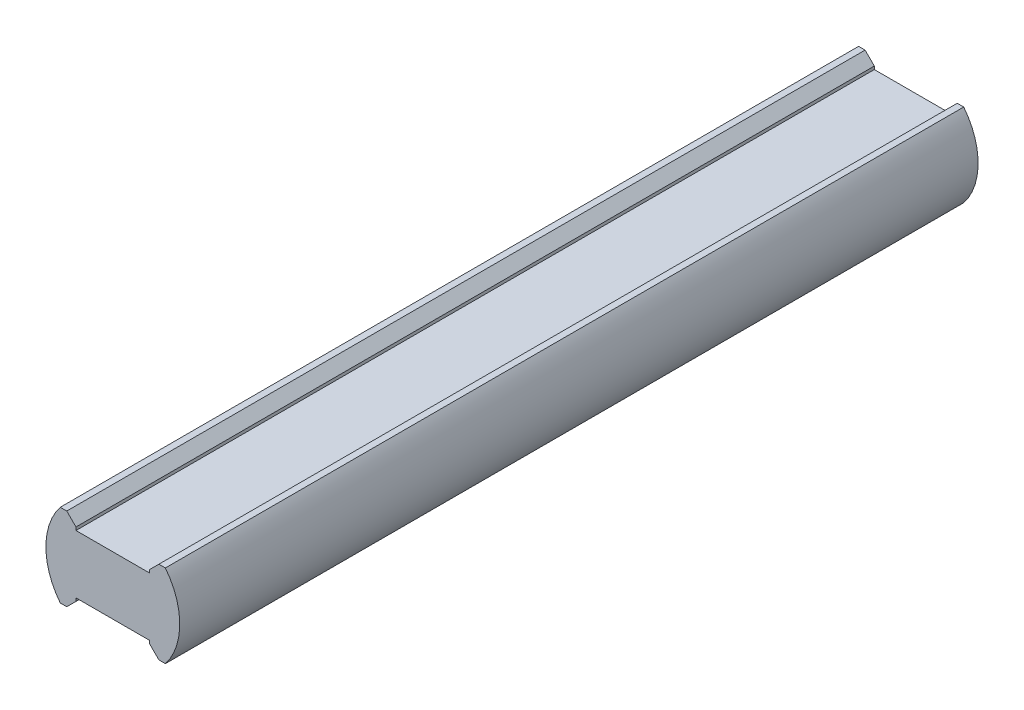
ISO-10303-21;
HEADER;
FILE_DESCRIPTION(('STEP AP214'),'2;1');
FILE_NAME('part.step','',(''),(''),'','','');
FILE_SCHEMA(('AUTOMOTIVE_DESIGN { 1 0 10303 214 1 1 1 1 }'));
ENDSEC;
DATA;
#1=APPLICATION_CONTEXT('core data for automotive mechanical design processes');
#2=APPLICATION_PROTOCOL_DEFINITION('international standard','automotive_design',2000,#1);
#3=PRODUCT_CONTEXT('',#1,'mechanical');
#4=PRODUCT('Part','Part','',(#3));
#5=PRODUCT_RELATED_PRODUCT_CATEGORY('part','',(#4));
#6=PRODUCT_DEFINITION_FORMATION('','',#4);
#7=PRODUCT_DEFINITION_CONTEXT('part definition',#1,'design');
#8=PRODUCT_DEFINITION('design','',#6,#7);
#9=PRODUCT_DEFINITION_SHAPE('','',#8);
#10=(LENGTH_UNIT() NAMED_UNIT(*) SI_UNIT(.MILLI.,.METRE.));
#11=(NAMED_UNIT(*) PLANE_ANGLE_UNIT() SI_UNIT($,.RADIAN.));
#12=(NAMED_UNIT(*) SI_UNIT($,.STERADIAN.) SOLID_ANGLE_UNIT());
#13=UNCERTAINTY_MEASURE_WITH_UNIT(LENGTH_MEASURE(1.E-05),#10,'distance_accuracy_value','');
#14=(GEOMETRIC_REPRESENTATION_CONTEXT(3) GLOBAL_UNCERTAINTY_ASSIGNED_CONTEXT((#13)) GLOBAL_UNIT_ASSIGNED_CONTEXT((#10,
#11,#12)) REPRESENTATION_CONTEXT('',''));
#15=CARTESIAN_POINT('',(0.,0.,0.));
#16=DIRECTION('',(0.,0.,1.));
#17=DIRECTION('',(1.,0.,0.));
#18=AXIS2_PLACEMENT_3D('',#15,#16,#17);
#19=CARTESIAN_POINT('',(7.5,6.75,130.));
#20=DIRECTION('',(0.,-1.,0.));
#21=DIRECTION('',(0.,0.,-1.));
#22=AXIS2_PLACEMENT_3D('',#19,#20,#21);
#23=PLANE('',#22);
#24=DIRECTION('',(-1.,0.,0.));
#25=VECTOR('',#24,1.);
#26=CARTESIAN_POINT('',(7.5,6.75,0.));
#27=LINE('',#26,#25);
#28=CARTESIAN_POINT('',(8.55847533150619,6.75,0.));
#29=VERTEX_POINT('',#28);
#30=CARTESIAN_POINT('',(7.5,6.75,0.));
#31=VERTEX_POINT('',#30);
#32=EDGE_CURVE('E193',#29,#31,#27,.T.);
#33=ORIENTED_EDGE('',*,*,#32,.T.);
#34=DIRECTION('',(0.,0.,-1.));
#35=VECTOR('',#34,1.);
#36=CARTESIAN_POINT('',(7.5,6.75,130.));
#37=LINE('',#36,#35);
#38=CARTESIAN_POINT('',(7.5,6.75,130.));
#39=VERTEX_POINT('',#38);
#40=EDGE_CURVE('E48',#39,#31,#37,.T.);
#41=ORIENTED_EDGE('',*,*,#40,.F.);
#42=DIRECTION('',(-1.,0.,0.));
#43=VECTOR('',#42,1.);
#44=CARTESIAN_POINT('',(7.5,6.75,130.));
#45=LINE('',#44,#43);
#46=CARTESIAN_POINT('',(8.55847533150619,6.75,130.));
#47=VERTEX_POINT('',#46);
#48=EDGE_CURVE('E125',#47,#39,#45,.T.);
#49=ORIENTED_EDGE('',*,*,#48,.F.);
#50=DIRECTION('',(0.,0.,-1.));
#51=VECTOR('',#50,1.);
#52=CARTESIAN_POINT('',(8.55847533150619,6.75,130.));
#53=LINE('',#52,#51);
#54=EDGE_CURVE('E11',#47,#29,#53,.T.);
#55=ORIENTED_EDGE('',*,*,#54,.T.);
#56=EDGE_LOOP('',(#33,#41,#49,#55));
#57=FACE_BOUND('',#56,.T.);
#58=ADVANCED_FACE('F39',(#57),#23,.F.);
#59=CARTESIAN_POINT('',(6.,5.25,130.));
#60=DIRECTION('',(0.707106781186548,-0.707106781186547,0.));
#61=DIRECTION('',(0.707106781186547,0.707106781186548,0.));
#62=AXIS2_PLACEMENT_3D('',#59,#60,#61);
#63=PLANE('',#62);
#64=DIRECTION('',(-0.707106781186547,-0.707106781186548,0.));
#65=VECTOR('',#64,1.);
#66=CARTESIAN_POINT('',(6.,5.25,0.));
#67=LINE('',#66,#65);
#68=CARTESIAN_POINT('',(6.,5.25,0.));
#69=VERTEX_POINT('',#68);
#70=EDGE_CURVE('E196',#31,#69,#67,.T.);
#71=ORIENTED_EDGE('',*,*,#70,.T.);
#72=DIRECTION('',(0.,0.,-1.));
#73=VECTOR('',#72,1.);
#74=CARTESIAN_POINT('',(6.,5.25,130.));
#75=LINE('',#74,#73);
#76=CARTESIAN_POINT('',(6.,5.25,130.));
#77=VERTEX_POINT('',#76);
#78=EDGE_CURVE('E281',#77,#69,#75,.T.);
#79=ORIENTED_EDGE('',*,*,#78,.F.);
#80=DIRECTION('',(-0.707106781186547,-0.707106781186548,0.));
#81=VECTOR('',#80,1.);
#82=CARTESIAN_POINT('',(6.,5.25,130.));
#83=LINE('',#82,#81);
#84=EDGE_CURVE('E291',#39,#77,#83,.T.);
#85=ORIENTED_EDGE('',*,*,#84,.F.);
#86=ORIENTED_EDGE('',*,*,#40,.T.);
#87=EDGE_LOOP('',(#71,#79,#85,#86));
#88=FACE_BOUND('',#87,.T.);
#89=ADVANCED_FACE('F289',(#88),#63,.F.);
#90=CARTESIAN_POINT('',(6.,5.25,130.));
#91=DIRECTION('',(1.,0.,0.));
#92=DIRECTION('',(0.,1.,0.));
#93=AXIS2_PLACEMENT_3D('',#90,#91,#92);
#94=PLANE('',#93);
#95=DIRECTION('',(0.,-1.,0.));
#96=VECTOR('',#95,1.);
#97=CARTESIAN_POINT('',(6.,5.25,0.));
#98=LINE('',#97,#96);
#99=CARTESIAN_POINT('',(6.,4.75,0.));
#100=VERTEX_POINT('',#99);
#101=EDGE_CURVE('E199',#69,#100,#98,.T.);
#102=ORIENTED_EDGE('',*,*,#101,.T.);
#103=DIRECTION('',(0.,0.,-1.));
#104=VECTOR('',#103,1.);
#105=CARTESIAN_POINT('',(6.,4.75,130.));
#106=LINE('',#105,#104);
#107=CARTESIAN_POINT('',(6.,4.75,130.));
#108=VERTEX_POINT('',#107);
#109=EDGE_CURVE('E277',#108,#100,#106,.T.);
#110=ORIENTED_EDGE('',*,*,#109,.F.);
#111=DIRECTION('',(0.,-1.,0.));
#112=VECTOR('',#111,1.);
#113=CARTESIAN_POINT('',(6.,5.25,130.));
#114=LINE('',#113,#112);
#115=EDGE_CURVE('E308',#77,#108,#114,.T.);
#116=ORIENTED_EDGE('',*,*,#115,.F.);
#117=ORIENTED_EDGE('',*,*,#78,.T.);
#118=EDGE_LOOP('',(#102,#110,#116,#117));
#119=FACE_BOUND('',#118,.T.);
#120=ADVANCED_FACE('F298',(#119),#94,.F.);
#121=CARTESIAN_POINT('',(-6.,4.75,130.));
#122=DIRECTION('',(0.,-1.,0.));
#123=DIRECTION('',(1.,0.,0.));
#124=AXIS2_PLACEMENT_3D('',#121,#122,#123);
#125=PLANE('',#124);
#126=DIRECTION('',(-1.,0.,0.));
#127=VECTOR('',#126,1.);
#128=CARTESIAN_POINT('',(-6.,4.75,0.));
#129=LINE('',#128,#127);
#130=CARTESIAN_POINT('',(-6.,4.75,0.));
#131=VERTEX_POINT('',#130);
#132=EDGE_CURVE('E202',#100,#131,#129,.T.);
#133=ORIENTED_EDGE('',*,*,#132,.T.);
#134=DIRECTION('',(0.,0.,-1.));
#135=VECTOR('',#134,1.);
#136=CARTESIAN_POINT('',(-6.,4.75,130.));
#137=LINE('',#136,#135);
#138=CARTESIAN_POINT('',(-6.,4.75,130.));
#139=VERTEX_POINT('',#138);
#140=EDGE_CURVE('E273',#139,#131,#137,.T.);
#141=ORIENTED_EDGE('',*,*,#140,.F.);
#142=DIRECTION('',(-1.,0.,0.));
#143=VECTOR('',#142,1.);
#144=CARTESIAN_POINT('',(-6.,4.75,130.));
#145=LINE('',#144,#143);
#146=EDGE_CURVE('E304',#108,#139,#145,.T.);
#147=ORIENTED_EDGE('',*,*,#146,.F.);
#148=ORIENTED_EDGE('',*,*,#109,.T.);
#149=EDGE_LOOP('',(#133,#141,#147,#148));
#150=FACE_BOUND('',#149,.T.);
#151=ADVANCED_FACE('F302',(#150),#125,.F.);
#152=CARTESIAN_POINT('',(-6.,5.25,130.));
#153=DIRECTION('',(-1.,0.,0.));
#154=DIRECTION('',(0.,0.,1.));
#155=AXIS2_PLACEMENT_3D('',#152,#153,#154);
#156=PLANE('',#155);
#157=DIRECTION('',(0.,1.,0.));
#158=VECTOR('',#157,1.);
#159=CARTESIAN_POINT('',(-6.,5.25,0.));
#160=LINE('',#159,#158);
#161=CARTESIAN_POINT('',(-6.,5.25,0.));
#162=VERTEX_POINT('',#161);
#163=EDGE_CURVE('E205',#131,#162,#160,.T.);
#164=ORIENTED_EDGE('',*,*,#163,.T.);
#165=DIRECTION('',(0.,0.,-1.));
#166=VECTOR('',#165,1.);
#167=CARTESIAN_POINT('',(-6.,5.25,130.));
#168=LINE('',#167,#166);
#169=CARTESIAN_POINT('',(-6.,5.25,130.));
#170=VERTEX_POINT('',#169);
#171=EDGE_CURVE('E269',#170,#162,#168,.T.);
#172=ORIENTED_EDGE('',*,*,#171,.F.);
#173=DIRECTION('',(0.,1.,0.));
#174=VECTOR('',#173,1.);
#175=CARTESIAN_POINT('',(-6.,5.25,130.));
#176=LINE('',#175,#174);
#177=EDGE_CURVE('E307',#139,#170,#176,.T.);
#178=ORIENTED_EDGE('',*,*,#177,.F.);
#179=ORIENTED_EDGE('',*,*,#140,.T.);
#180=EDGE_LOOP('',(#164,#172,#178,#179));
#181=FACE_BOUND('',#180,.T.);
#182=ADVANCED_FACE('F359',(#181),#156,.F.);
#183=CARTESIAN_POINT('',(-7.5,6.75,130.));
#184=DIRECTION('',(-0.707106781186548,-0.707106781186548,0.));
#185=DIRECTION('',(0.707106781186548,-0.707106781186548,0.));
#186=AXIS2_PLACEMENT_3D('',#183,#184,#185);
#187=PLANE('',#186);
#188=DIRECTION('',(-0.707106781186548,0.707106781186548,0.));
#189=VECTOR('',#188,1.);
#190=CARTESIAN_POINT('',(-7.5,6.75,0.));
#191=LINE('',#190,#189);
#192=CARTESIAN_POINT('',(-7.5,6.75,0.));
#193=VERTEX_POINT('',#192);
#194=EDGE_CURVE('E208',#162,#193,#191,.T.);
#195=ORIENTED_EDGE('',*,*,#194,.T.);
#196=DIRECTION('',(0.,0.,-1.));
#197=VECTOR('',#196,1.);
#198=CARTESIAN_POINT('',(-7.5,6.75,130.));
#199=LINE('',#198,#197);
#200=CARTESIAN_POINT('',(-7.5,6.75,130.));
#201=VERTEX_POINT('',#200);
#202=EDGE_CURVE('E265',#201,#193,#199,.T.);
#203=ORIENTED_EDGE('',*,*,#202,.F.);
#204=DIRECTION('',(-0.707106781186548,0.707106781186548,0.));
#205=VECTOR('',#204,1.);
#206=CARTESIAN_POINT('',(-7.5,6.75,130.));
#207=LINE('',#206,#205);
#208=EDGE_CURVE('E312',#170,#201,#207,.T.);
#209=ORIENTED_EDGE('',*,*,#208,.F.);
#210=ORIENTED_EDGE('',*,*,#171,.T.);
#211=EDGE_LOOP('',(#195,#203,#209,#210));
#212=FACE_BOUND('',#211,.T.);
#213=ADVANCED_FACE('F362',(#212),#187,.F.);
#214=CARTESIAN_POINT('',(-8.55847533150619,6.75,130.));
#215=DIRECTION('',(0.,-1.,0.));
#216=DIRECTION('',(0.,0.,-1.));
#217=AXIS2_PLACEMENT_3D('',#214,#215,#216);
#218=PLANE('',#217);
#219=DIRECTION('',(-1.,0.,0.));
#220=VECTOR('',#219,1.);
#221=CARTESIAN_POINT('',(-8.55847533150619,6.75,0.));
#222=LINE('',#221,#220);
#223=CARTESIAN_POINT('',(-8.55847533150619,6.75,0.));
#224=VERTEX_POINT('',#223);
#225=EDGE_CURVE('E211',#193,#224,#222,.T.);
#226=ORIENTED_EDGE('',*,*,#225,.T.);
#227=DIRECTION('',(0.,0.,-1.));
#228=VECTOR('',#227,1.);
#229=CARTESIAN_POINT('',(-8.55847533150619,6.75,130.));
#230=LINE('',#229,#228);
#231=CARTESIAN_POINT('',(-8.55847533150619,6.75,130.));
#232=VERTEX_POINT('',#231);
#233=EDGE_CURVE('E261',#232,#224,#230,.T.);
#234=ORIENTED_EDGE('',*,*,#233,.F.);
#235=DIRECTION('',(-1.,0.,0.));
#236=VECTOR('',#235,1.);
#237=CARTESIAN_POINT('',(-8.55847533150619,6.75,130.));
#238=LINE('',#237,#236);
#239=EDGE_CURVE('E319',#201,#232,#238,.T.);
#240=ORIENTED_EDGE('',*,*,#239,.F.);
#241=ORIENTED_EDGE('',*,*,#202,.T.);
#242=EDGE_LOOP('',(#226,#234,#240,#241));
#243=FACE_BOUND('',#242,.T.);
#244=ADVANCED_FACE('F366',(#243),#218,.F.);
#245=CARTESIAN_POINT('',(0.,0.,130.));
#246=DIRECTION('',(0.,0.,-1.));
#247=DIRECTION('',(-1.,0.,0.));
#248=AXIS2_PLACEMENT_3D('',#245,#246,#247);
#249=CYLINDRICAL_SURFACE('',#248,10.9);
#250=CARTESIAN_POINT('',(0.,0.,0.));
#251=DIRECTION('',(0.,0.,1.));
#252=DIRECTION('',(1.,0.,0.));
#253=AXIS2_PLACEMENT_3D('',#250,#251,#252);
#254=CIRCLE('',#253,10.9);
#255=CARTESIAN_POINT('',(-8.55847533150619,-6.75,0.));
#256=VERTEX_POINT('',#255);
#257=EDGE_CURVE('E215',#224,#256,#254,.T.);
#258=ORIENTED_EDGE('',*,*,#257,.T.);
#259=DIRECTION('',(0.,0.,-1.));
#260=VECTOR('',#259,1.);
#261=CARTESIAN_POINT('',(-8.55847533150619,-6.75,130.));
#262=LINE('',#261,#260);
#263=CARTESIAN_POINT('',(-8.55847533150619,-6.75,130.));
#264=VERTEX_POINT('',#263);
#265=EDGE_CURVE('E257',#264,#256,#262,.T.);
#266=ORIENTED_EDGE('',*,*,#265,.F.);
#267=CARTESIAN_POINT('',(0.,0.,130.));
#268=DIRECTION('',(0.,0.,1.));
#269=DIRECTION('',(1.,0.,0.));
#270=AXIS2_PLACEMENT_3D('',#267,#268,#269);
#271=CIRCLE('',#270,10.9);
#272=EDGE_CURVE('E322',#232,#264,#271,.T.);
#273=ORIENTED_EDGE('',*,*,#272,.F.);
#274=ORIENTED_EDGE('',*,*,#233,.T.);
#275=EDGE_LOOP('',(#258,#266,#273,#274));
#276=FACE_BOUND('',#275,.T.);
#277=ADVANCED_FACE('F370',(#276),#249,.T.);
#278=CARTESIAN_POINT('',(-8.55847533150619,-6.75,130.));
#279=DIRECTION('',(0.,1.,0.));
#280=DIRECTION('',(0.,0.,1.));
#281=AXIS2_PLACEMENT_3D('',#278,#279,#280);
#282=PLANE('',#281);
#283=DIRECTION('',(1.,0.,0.));
#284=VECTOR('',#283,1.);
#285=CARTESIAN_POINT('',(-8.55847533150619,-6.75,0.));
#286=LINE('',#285,#284);
#287=CARTESIAN_POINT('',(-7.5,-6.75,0.));
#288=VERTEX_POINT('',#287);
#289=EDGE_CURVE('E218',#256,#288,#286,.T.);
#290=ORIENTED_EDGE('',*,*,#289,.T.);
#291=DIRECTION('',(0.,0.,-1.));
#292=VECTOR('',#291,1.);
#293=CARTESIAN_POINT('',(-7.5,-6.75,130.));
#294=LINE('',#293,#292);
#295=CARTESIAN_POINT('',(-7.5,-6.75,130.));
#296=VERTEX_POINT('',#295);
#297=EDGE_CURVE('E253',#296,#288,#294,.T.);
#298=ORIENTED_EDGE('',*,*,#297,.F.);
#299=DIRECTION('',(1.,0.,0.));
#300=VECTOR('',#299,1.);
#301=CARTESIAN_POINT('',(-8.55847533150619,-6.75,130.));
#302=LINE('',#301,#300);
#303=EDGE_CURVE('E325',#264,#296,#302,.T.);
#304=ORIENTED_EDGE('',*,*,#303,.F.);
#305=ORIENTED_EDGE('',*,*,#265,.T.);
#306=EDGE_LOOP('',(#290,#298,#304,#305));
#307=FACE_BOUND('',#306,.T.);
#308=ADVANCED_FACE('F374',(#307),#282,.F.);
#309=CARTESIAN_POINT('',(-7.5,-6.75,130.));
#310=DIRECTION('',(-0.707106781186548,0.707106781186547,0.));
#311=DIRECTION('',(-0.707106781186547,-0.707106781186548,0.));
#312=AXIS2_PLACEMENT_3D('',#309,#310,#311);
#313=PLANE('',#312);
#314=DIRECTION('',(0.707106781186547,0.707106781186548,0.));
#315=VECTOR('',#314,1.);
#316=CARTESIAN_POINT('',(-7.5,-6.75,0.));
#317=LINE('',#316,#315);
#318=CARTESIAN_POINT('',(-6.,-5.25,0.));
#319=VERTEX_POINT('',#318);
#320=EDGE_CURVE('E221',#288,#319,#317,.T.);
#321=ORIENTED_EDGE('',*,*,#320,.T.);
#322=DIRECTION('',(0.,0.,-1.));
#323=VECTOR('',#322,1.);
#324=CARTESIAN_POINT('',(-6.,-5.25,130.));
#325=LINE('',#324,#323);
#326=CARTESIAN_POINT('',(-6.,-5.25,130.));
#327=VERTEX_POINT('',#326);
#328=EDGE_CURVE('E249',#327,#319,#325,.T.);
#329=ORIENTED_EDGE('',*,*,#328,.F.);
#330=DIRECTION('',(0.707106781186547,0.707106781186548,0.));
#331=VECTOR('',#330,1.);
#332=CARTESIAN_POINT('',(-7.5,-6.75,130.));
#333=LINE('',#332,#331);
#334=EDGE_CURVE('E328',#296,#327,#333,.T.);
#335=ORIENTED_EDGE('',*,*,#334,.F.);
#336=ORIENTED_EDGE('',*,*,#297,.T.);
#337=EDGE_LOOP('',(#321,#329,#335,#336));
#338=FACE_BOUND('',#337,.T.);
#339=ADVANCED_FACE('F378',(#338),#313,.F.);
#340=CARTESIAN_POINT('',(-6.,-5.25,130.));
#341=DIRECTION('',(-1.,0.,0.));
#342=DIRECTION('',(0.,0.,1.));
#343=AXIS2_PLACEMENT_3D('',#340,#341,#342);
#344=PLANE('',#343);
#345=DIRECTION('',(0.,1.,0.));
#346=VECTOR('',#345,1.);
#347=CARTESIAN_POINT('',(-6.,-5.25,0.));
#348=LINE('',#347,#346);
#349=CARTESIAN_POINT('',(-6.,-4.75,0.));
#350=VERTEX_POINT('',#349);
#351=EDGE_CURVE('E224',#319,#350,#348,.T.);
#352=ORIENTED_EDGE('',*,*,#351,.T.);
#353=DIRECTION('',(0.,0.,-1.));
#354=VECTOR('',#353,1.);
#355=CARTESIAN_POINT('',(-6.,-4.75,130.));
#356=LINE('',#355,#354);
#357=CARTESIAN_POINT('',(-6.,-4.75,130.));
#358=VERTEX_POINT('',#357);
#359=EDGE_CURVE('E245',#358,#350,#356,.T.);
#360=ORIENTED_EDGE('',*,*,#359,.F.);
#361=DIRECTION('',(0.,1.,0.));
#362=VECTOR('',#361,1.);
#363=CARTESIAN_POINT('',(-6.,-5.25,130.));
#364=LINE('',#363,#362);
#365=EDGE_CURVE('E331',#327,#358,#364,.T.);
#366=ORIENTED_EDGE('',*,*,#365,.F.);
#367=ORIENTED_EDGE('',*,*,#328,.T.);
#368=EDGE_LOOP('',(#352,#360,#366,#367));
#369=FACE_BOUND('',#368,.T.);
#370=ADVANCED_FACE('F339',(#369),#344,.F.);
#371=CARTESIAN_POINT('',(-6.,-4.75,130.));
#372=DIRECTION('',(0.,1.,0.));
#373=DIRECTION('',(-1.,0.,0.));
#374=AXIS2_PLACEMENT_3D('',#371,#372,#373);
#375=PLANE('',#374);
#376=DIRECTION('',(1.,0.,0.));
#377=VECTOR('',#376,1.);
#378=CARTESIAN_POINT('',(-6.,-4.75,0.));
#379=LINE('',#378,#377);
#380=CARTESIAN_POINT('',(6.,-4.75,0.));
#381=VERTEX_POINT('',#380);
#382=EDGE_CURVE('E227',#350,#381,#379,.T.);
#383=ORIENTED_EDGE('',*,*,#382,.T.);
#384=DIRECTION('',(0.,0.,-1.));
#385=VECTOR('',#384,1.);
#386=CARTESIAN_POINT('',(6.,-4.75,130.));
#387=LINE('',#386,#385);
#388=CARTESIAN_POINT('',(6.,-4.75,130.));
#389=VERTEX_POINT('',#388);
#390=EDGE_CURVE('E180',#389,#381,#387,.T.);
#391=ORIENTED_EDGE('',*,*,#390,.F.);
#392=DIRECTION('',(1.,0.,0.));
#393=VECTOR('',#392,1.);
#394=CARTESIAN_POINT('',(-6.,-4.75,130.));
#395=LINE('',#394,#393);
#396=EDGE_CURVE('E169',#358,#389,#395,.T.);
#397=ORIENTED_EDGE('',*,*,#396,.F.);
#398=ORIENTED_EDGE('',*,*,#359,.T.);
#399=EDGE_LOOP('',(#383,#391,#397,#398));
#400=FACE_BOUND('',#399,.T.);
#401=ADVANCED_FACE('F343',(#400),#375,.F.);
#402=CARTESIAN_POINT('',(6.,-5.25,130.));
#403=DIRECTION('',(1.,0.,0.));
#404=DIRECTION('',(0.,0.,-1.));
#405=AXIS2_PLACEMENT_3D('',#402,#403,#404);
#406=PLANE('',#405);
#407=DIRECTION('',(0.,-1.,0.));
#408=VECTOR('',#407,1.);
#409=CARTESIAN_POINT('',(6.,-5.25,0.));
#410=LINE('',#409,#408);
#411=CARTESIAN_POINT('',(6.,-5.25,0.));
#412=VERTEX_POINT('',#411);
#413=EDGE_CURVE('E178',#381,#412,#410,.T.);
#414=ORIENTED_EDGE('',*,*,#413,.T.);
#415=DIRECTION('',(0.,0.,-1.));
#416=VECTOR('',#415,1.);
#417=CARTESIAN_POINT('',(6.,-5.25,130.));
#418=LINE('',#417,#416);
#419=CARTESIAN_POINT('',(6.,-5.25,130.));
#420=VERTEX_POINT('',#419);
#421=EDGE_CURVE('E175',#420,#412,#418,.T.);
#422=ORIENTED_EDGE('',*,*,#421,.F.);
#423=DIRECTION('',(0.,-1.,0.));
#424=VECTOR('',#423,1.);
#425=CARTESIAN_POINT('',(6.,-5.25,130.));
#426=LINE('',#425,#424);
#427=EDGE_CURVE('E163',#389,#420,#426,.T.);
#428=ORIENTED_EDGE('',*,*,#427,.F.);
#429=ORIENTED_EDGE('',*,*,#390,.T.);
#430=EDGE_LOOP('',(#414,#422,#428,#429));
#431=FACE_BOUND('',#430,.T.);
#432=ADVANCED_FACE('F176',(#431),#406,.F.);
#433=CARTESIAN_POINT('',(6.,-5.25,130.));
#434=DIRECTION('',(0.707106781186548,0.707106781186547,0.));
#435=DIRECTION('',(-0.707106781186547,0.707106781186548,0.));
#436=AXIS2_PLACEMENT_3D('',#433,#434,#435);
#437=PLANE('',#436);
#438=DIRECTION('',(0.707106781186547,-0.707106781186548,0.));
#439=VECTOR('',#438,1.);
#440=CARTESIAN_POINT('',(6.,-5.25,0.));
#441=LINE('',#440,#439);
#442=CARTESIAN_POINT('',(7.5,-6.75,0.));
#443=VERTEX_POINT('',#442);
#444=EDGE_CURVE('E110',#412,#443,#441,.T.);
#445=ORIENTED_EDGE('',*,*,#444,.T.);
#446=DIRECTION('',(0.,0.,-1.));
#447=VECTOR('',#446,1.);
#448=CARTESIAN_POINT('',(7.5,-6.75,130.));
#449=LINE('',#448,#447);
#450=CARTESIAN_POINT('',(7.5,-6.75,130.));
#451=VERTEX_POINT('',#450);
#452=EDGE_CURVE('E181',#451,#443,#449,.T.);
#453=ORIENTED_EDGE('',*,*,#452,.F.);
#454=DIRECTION('',(0.707106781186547,-0.707106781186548,0.));
#455=VECTOR('',#454,1.);
#456=CARTESIAN_POINT('',(6.,-5.25,130.));
#457=LINE('',#456,#455);
#458=EDGE_CURVE('E167',#420,#451,#457,.T.);
#459=ORIENTED_EDGE('',*,*,#458,.F.);
#460=ORIENTED_EDGE('',*,*,#421,.T.);
#461=EDGE_LOOP('',(#445,#453,#459,#460));
#462=FACE_BOUND('',#461,.T.);
#463=ADVANCED_FACE('F183',(#462),#437,.F.);
#464=CARTESIAN_POINT('',(7.5,-6.75,130.));
#465=DIRECTION('',(0.,1.,0.));
#466=DIRECTION('',(0.,0.,1.));
#467=AXIS2_PLACEMENT_3D('',#464,#465,#466);
#468=PLANE('',#467);
#469=DIRECTION('',(1.,0.,0.));
#470=VECTOR('',#469,1.);
#471=CARTESIAN_POINT('',(7.5,-6.75,0.));
#472=LINE('',#471,#470);
#473=CARTESIAN_POINT('',(8.55847533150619,-6.75,0.));
#474=VERTEX_POINT('',#473);
#475=EDGE_CURVE('E234',#443,#474,#472,.T.);
#476=ORIENTED_EDGE('',*,*,#475,.T.);
#477=DIRECTION('',(0.,0.,-1.));
#478=VECTOR('',#477,1.);
#479=CARTESIAN_POINT('',(8.55847533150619,-6.75,130.));
#480=LINE('',#479,#478);
#481=CARTESIAN_POINT('',(8.55847533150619,-6.75,130.));
#482=VERTEX_POINT('',#481);
#483=EDGE_CURVE('E189',#482,#474,#480,.T.);
#484=ORIENTED_EDGE('',*,*,#483,.F.);
#485=DIRECTION('',(1.,0.,0.));
#486=VECTOR('',#485,1.);
#487=CARTESIAN_POINT('',(7.5,-6.75,130.));
#488=LINE('',#487,#486);
#489=EDGE_CURVE('E186',#451,#482,#488,.T.);
#490=ORIENTED_EDGE('',*,*,#489,.F.);
#491=ORIENTED_EDGE('',*,*,#452,.T.);
#492=EDGE_LOOP('',(#476,#484,#490,#491));
#493=FACE_BOUND('',#492,.T.);
#494=ADVANCED_FACE('F346',(#493),#468,.F.);
#495=CARTESIAN_POINT('',(0.,0.,130.));
#496=DIRECTION('',(0.,0.,-1.));
#497=DIRECTION('',(-1.,0.,0.));
#498=AXIS2_PLACEMENT_3D('',#495,#496,#497);
#499=CYLINDRICAL_SURFACE('',#498,10.9);
#500=CARTESIAN_POINT('',(0.,0.,0.));
#501=DIRECTION('',(0.,0.,1.));
#502=DIRECTION('',(1.,0.,0.));
#503=AXIS2_PLACEMENT_3D('',#500,#501,#502);
#504=CIRCLE('',#503,10.9);
#505=EDGE_CURVE('E117',#474,#29,#504,.T.);
#506=ORIENTED_EDGE('',*,*,#505,.T.);
#507=ORIENTED_EDGE('',*,*,#54,.F.);
#508=CARTESIAN_POINT('',(0.,0.,130.));
#509=DIRECTION('',(0.,0.,1.));
#510=DIRECTION('',(-1.,0.,0.));
#511=AXIS2_PLACEMENT_3D('',#508,#509,#510);
#512=CIRCLE('',#511,10.9);
#513=EDGE_CURVE('E56',#482,#47,#512,.T.);
#514=ORIENTED_EDGE('',*,*,#513,.F.);
#515=ORIENTED_EDGE('',*,*,#483,.T.);
#516=EDGE_LOOP('',(#506,#507,#514,#515));
#517=FACE_BOUND('',#516,.T.);
#518=ADVANCED_FACE('F347',(#517),#499,.T.);
#519=CARTESIAN_POINT('',(0.,0.,130.));
#520=DIRECTION('',(0.,0.,-1.));
#521=DIRECTION('',(-1.,0.,0.));
#522=AXIS2_PLACEMENT_3D('',#519,#520,#521);
#523=PLANE('',#522);
#524=ORIENTED_EDGE('',*,*,#513,.T.);
#525=ORIENTED_EDGE('',*,*,#48,.T.);
#526=ORIENTED_EDGE('',*,*,#84,.T.);
#527=ORIENTED_EDGE('',*,*,#115,.T.);
#528=ORIENTED_EDGE('',*,*,#146,.T.);
#529=ORIENTED_EDGE('',*,*,#177,.T.);
#530=ORIENTED_EDGE('',*,*,#208,.T.);
#531=ORIENTED_EDGE('',*,*,#239,.T.);
#532=ORIENTED_EDGE('',*,*,#272,.T.);
#533=ORIENTED_EDGE('',*,*,#303,.T.);
#534=ORIENTED_EDGE('',*,*,#334,.T.);
#535=ORIENTED_EDGE('',*,*,#365,.T.);
#536=ORIENTED_EDGE('',*,*,#396,.T.);
#537=ORIENTED_EDGE('',*,*,#427,.T.);
#538=ORIENTED_EDGE('',*,*,#458,.T.);
#539=ORIENTED_EDGE('',*,*,#489,.T.);
#540=EDGE_LOOP('',(#524,#525,#526,#527,#528,#529,#530,#531,#532,#533,#534,#535,#536,#537,#538,#539));
#541=FACE_BOUND('',#540,.T.);
#542=ADVANCED_FACE('F165',(#541),#523,.F.);
#543=CARTESIAN_POINT('',(0.,0.,0.));
#544=DIRECTION('',(0.,0.,-1.));
#545=DIRECTION('',(-1.,0.,0.));
#546=AXIS2_PLACEMENT_3D('',#543,#544,#545);
#547=PLANE('',#546);
#548=ORIENTED_EDGE('',*,*,#32,.F.);
#549=ORIENTED_EDGE('',*,*,#505,.F.);
#550=ORIENTED_EDGE('',*,*,#475,.F.);
#551=ORIENTED_EDGE('',*,*,#444,.F.);
#552=ORIENTED_EDGE('',*,*,#413,.F.);
#553=ORIENTED_EDGE('',*,*,#382,.F.);
#554=ORIENTED_EDGE('',*,*,#351,.F.);
#555=ORIENTED_EDGE('',*,*,#320,.F.);
#556=ORIENTED_EDGE('',*,*,#289,.F.);
#557=ORIENTED_EDGE('',*,*,#257,.F.);
#558=ORIENTED_EDGE('',*,*,#225,.F.);
#559=ORIENTED_EDGE('',*,*,#194,.F.);
#560=ORIENTED_EDGE('',*,*,#163,.F.);
#561=ORIENTED_EDGE('',*,*,#132,.F.);
#562=ORIENTED_EDGE('',*,*,#101,.F.);
#563=ORIENTED_EDGE('',*,*,#70,.F.);
#564=EDGE_LOOP('',(#548,#549,#550,#551,#552,#553,#554,#555,#556,#557,#558,#559,#560,#561,#562,#563));
#565=FACE_BOUND('',#564,.T.);
#566=ADVANCED_FACE('F293',(#565),#547,.T.);
#567=CLOSED_SHELL('',(#58,#89,#120,#151,#182,#213,#244,#277,#308,#339,#370,#401,#432,#463,#494,
#518,#542,#566));
#568=MANIFOLD_SOLID_BREP('B2',#567);
#569=ADVANCED_BREP_SHAPE_REPRESENTATION('',(#18,#568),#14);
#570=SHAPE_DEFINITION_REPRESENTATION(#9,#569);
ENDSEC;
END-ISO-10303-21;
